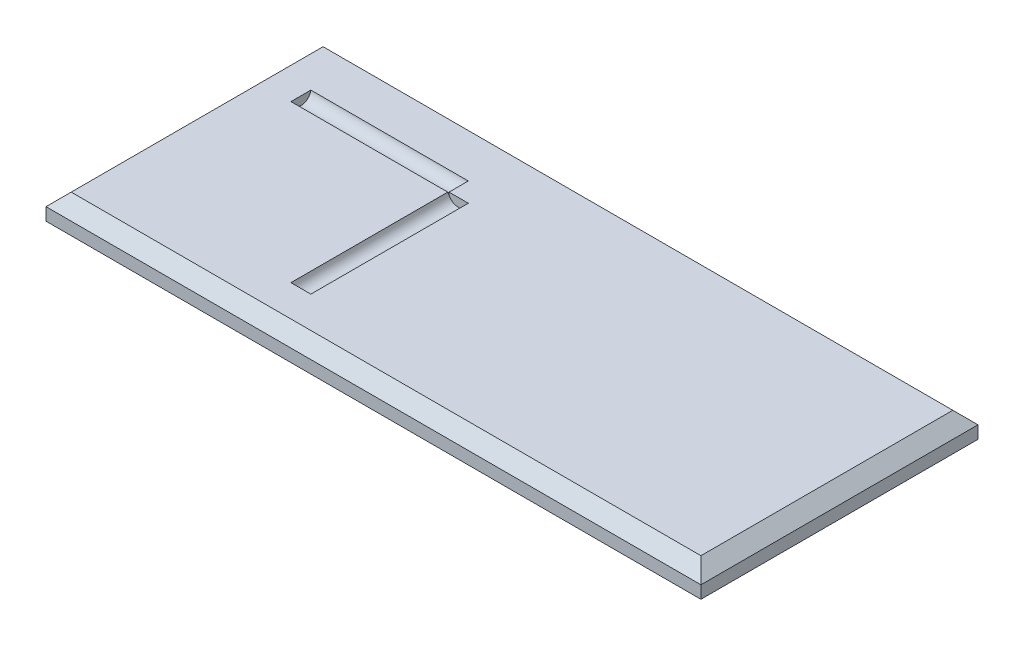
from build123d import *

# Parameters (mm, degrees)
SKETCH1_W          = 330.2
SKETCH1_H          = 12.7
BASE_EXTRUDE_DEPTH = 139.7
CHAMFER1_SIZE      = 6.35
CUT_EXTRUDE1_DEPTH = 79.375
CUT_EXTRUDE2_DEPTH = 79.375


with BuildPart() as part:
    # Sketch1 → Base-Extrude (new body)
    with BuildSketch(Plane.XY):
        with Locations((165.1, 6.35)):
            Rectangle(SKETCH1_W, SKETCH1_H)
    extrude(amount=-BASE_EXTRUDE_DEPTH)

    # Chamfer1
    chamfer1_edges = [part.edges().sort_by_distance(p)[0] for p in [
        (165.1, 12.7, 0),
        (165.1, 12.7, -139.7),
        (330.2, 12.7, -69.85),
        (0, 12.7, -69.85),
    ]]
    chamfer(chamfer1_edges, length=CHAMFER1_SIZE)

    # Sketch2 → Cut-Extrude1 (cut)
    with BuildSketch(Plane.XY.offset(-22.225)):
        with BuildLine():
            Line((111.313493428, 12.7), (101.278283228, 12.7))
            ThreePointArc((101.278283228, 12.7), (106.295888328, 8.41375), (111.313493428, 12.7))
        make_face()
    extrude(amount=-CUT_EXTRUDE1_DEPTH, mode=Mode.SUBTRACT)

    # Sketch3 → Cut-Extrude2 (cut)
    with BuildSketch(Plane.ZY.offset(-22.225)):
        with BuildLine():
            Line((-111.313493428, 12.7), (-101.278283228, 12.7))
            ThreePointArc((-101.278283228, 12.7), (-106.295888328, 8.41375), (-111.313493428, 12.7))
        make_face()
    extrude(amount=-CUT_EXTRUDE2_DEPTH, mode=Mode.SUBTRACT)


solid = part.part
